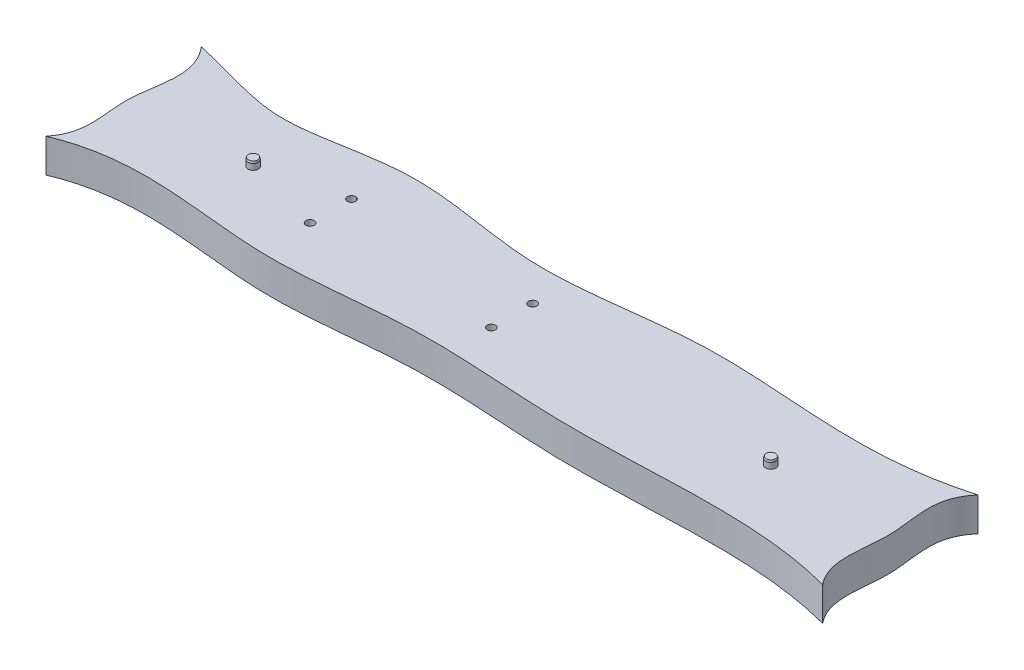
ISO-10303-21;
HEADER;
FILE_DESCRIPTION(('STEP AP214'),'2;1');
FILE_NAME('part.step','',(''),(''),'','','');
FILE_SCHEMA(('AUTOMOTIVE_DESIGN { 1 0 10303 214 1 1 1 1 }'));
ENDSEC;
DATA;
#1=APPLICATION_CONTEXT('core data for automotive mechanical design processes');
#2=APPLICATION_PROTOCOL_DEFINITION('international standard','automotive_design',2000,#1);
#3=PRODUCT_CONTEXT('',#1,'mechanical');
#4=PRODUCT('Part','Part','',(#3));
#5=PRODUCT_RELATED_PRODUCT_CATEGORY('part','',(#4));
#6=PRODUCT_DEFINITION_FORMATION('','',#4);
#7=PRODUCT_DEFINITION_CONTEXT('part definition',#1,'design');
#8=PRODUCT_DEFINITION('design','',#6,#7);
#9=PRODUCT_DEFINITION_SHAPE('','',#8);
#10=(LENGTH_UNIT() NAMED_UNIT(*) SI_UNIT(.MILLI.,.METRE.));
#11=(NAMED_UNIT(*) PLANE_ANGLE_UNIT() SI_UNIT($,.RADIAN.));
#12=(NAMED_UNIT(*) SI_UNIT($,.STERADIAN.) SOLID_ANGLE_UNIT());
#13=UNCERTAINTY_MEASURE_WITH_UNIT(LENGTH_MEASURE(1.E-05),#10,'distance_accuracy_value','');
#14=(GEOMETRIC_REPRESENTATION_CONTEXT(3) GLOBAL_UNCERTAINTY_ASSIGNED_CONTEXT((#13)) GLOBAL_UNIT_ASSIGNED_CONTEXT((#10,
#11,#12)) REPRESENTATION_CONTEXT('',''));
#15=CARTESIAN_POINT('',(0.,0.,0.));
#16=DIRECTION('',(0.,0.,1.));
#17=DIRECTION('',(1.,0.,0.));
#18=AXIS2_PLACEMENT_3D('',#15,#16,#17);
#19=CARTESIAN_POINT('',(-50.,0.35,0.));
#20=DIRECTION('',(0.,1.,0.));
#21=DIRECTION('',(1.,0.,0.));
#22=AXIS2_PLACEMENT_3D('',#19,#20,#21);
#23=CYLINDRICAL_SURFACE('',#22,1.);
#24=CARTESIAN_POINT('',(-50.,6.5,0.));
#25=DIRECTION('',(0.,1.,0.));
#26=DIRECTION('',(0.,0.,1.));
#27=AXIS2_PLACEMENT_3D('',#24,#25,#26);
#28=CIRCLE('',#27,1.);
#29=CARTESIAN_POINT('',(-49.,6.5,0.));
#30=VERTEX_POINT('',#29);
#31=EDGE_CURVE('E10',#30,#30,#28,.F.);
#32=CARTESIAN_POINT('',(-50.,7.65,0.));
#33=DIRECTION('',(0.,1.,0.));
#34=DIRECTION('',(1.,0.,0.));
#35=AXIS2_PLACEMENT_3D('',#32,#33,#34);
#36=CIRCLE('',#35,1.);
#37=CARTESIAN_POINT('',(-49.,7.65,0.));
#38=VERTEX_POINT('',#37);
#39=EDGE_CURVE('E24',#38,#38,#36,.T.);
#40=CARTESIAN_POINT('',(-49.,6.5,0.));
#41=CARTESIAN_POINT('',(-49.,6.51197916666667,0.));
#42=CARTESIAN_POINT('',(-49.,6.52395833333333,0.));
#43=CARTESIAN_POINT('',(-49.,6.54791666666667,0.));
#44=CARTESIAN_POINT('',(-49.,6.55989583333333,0.));
#45=CARTESIAN_POINT('',(-49.,6.58385416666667,0.));
#46=CARTESIAN_POINT('',(-49.,6.59583333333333,0.));
#47=CARTESIAN_POINT('',(-49.,6.61979166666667,0.));
#48=CARTESIAN_POINT('',(-49.,6.63177083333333,0.));
#49=CARTESIAN_POINT('',(-49.,6.65572916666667,0.));
#50=CARTESIAN_POINT('',(-49.,6.66770833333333,0.));
#51=CARTESIAN_POINT('',(-49.,6.69166666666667,0.));
#52=CARTESIAN_POINT('',(-49.,6.70364583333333,0.));
#53=CARTESIAN_POINT('',(-49.,6.72760416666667,0.));
#54=CARTESIAN_POINT('',(-49.,6.73958333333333,0.));
#55=CARTESIAN_POINT('',(-49.,6.76354166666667,0.));
#56=CARTESIAN_POINT('',(-49.,6.77552083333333,0.));
#57=CARTESIAN_POINT('',(-49.,6.79947916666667,0.));
#58=CARTESIAN_POINT('',(-49.,6.81145833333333,0.));
#59=CARTESIAN_POINT('',(-49.,6.83541666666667,0.));
#60=CARTESIAN_POINT('',(-49.,6.84739583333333,0.));
#61=CARTESIAN_POINT('',(-49.,6.87135416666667,0.));
#62=CARTESIAN_POINT('',(-49.,6.88333333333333,0.));
#63=CARTESIAN_POINT('',(-49.,6.90729166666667,0.));
#64=CARTESIAN_POINT('',(-49.,6.91927083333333,0.));
#65=CARTESIAN_POINT('',(-49.,6.94322916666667,0.));
#66=CARTESIAN_POINT('',(-49.,6.95520833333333,0.));
#67=CARTESIAN_POINT('',(-49.,6.97916666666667,0.));
#68=CARTESIAN_POINT('',(-49.,6.99114583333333,0.));
#69=CARTESIAN_POINT('',(-49.,7.01510416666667,0.));
#70=CARTESIAN_POINT('',(-49.,7.02708333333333,0.));
#71=CARTESIAN_POINT('',(-49.,7.05104166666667,0.));
#72=CARTESIAN_POINT('',(-49.,7.06302083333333,0.));
#73=CARTESIAN_POINT('',(-49.,7.08697916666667,0.));
#74=CARTESIAN_POINT('',(-49.,7.09895833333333,0.));
#75=CARTESIAN_POINT('',(-49.,7.12291666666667,0.));
#76=CARTESIAN_POINT('',(-49.,7.13489583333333,0.));
#77=CARTESIAN_POINT('',(-49.,7.15885416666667,0.));
#78=CARTESIAN_POINT('',(-49.,7.17083333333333,0.));
#79=CARTESIAN_POINT('',(-49.,7.19479166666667,0.));
#80=CARTESIAN_POINT('',(-49.,7.20677083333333,0.));
#81=CARTESIAN_POINT('',(-49.,7.23072916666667,0.));
#82=CARTESIAN_POINT('',(-49.,7.24270833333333,0.));
#83=CARTESIAN_POINT('',(-49.,7.26666666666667,0.));
#84=CARTESIAN_POINT('',(-49.,7.27864583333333,0.));
#85=CARTESIAN_POINT('',(-49.,7.30260416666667,0.));
#86=CARTESIAN_POINT('',(-49.,7.31458333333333,0.));
#87=CARTESIAN_POINT('',(-49.,7.33854166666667,0.));
#88=CARTESIAN_POINT('',(-49.,7.35052083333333,0.));
#89=CARTESIAN_POINT('',(-49.,7.37447916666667,0.));
#90=CARTESIAN_POINT('',(-49.,7.38645833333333,0.));
#91=CARTESIAN_POINT('',(-49.,7.41041666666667,0.));
#92=CARTESIAN_POINT('',(-49.,7.42239583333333,0.));
#93=CARTESIAN_POINT('',(-49.,7.44635416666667,0.));
#94=CARTESIAN_POINT('',(-49.,7.45833333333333,0.));
#95=CARTESIAN_POINT('',(-49.,7.48229166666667,0.));
#96=CARTESIAN_POINT('',(-49.,7.49427083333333,0.));
#97=CARTESIAN_POINT('',(-49.,7.51822916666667,0.));
#98=CARTESIAN_POINT('',(-49.,7.53020833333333,0.));
#99=CARTESIAN_POINT('',(-49.,7.55416666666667,0.));
#100=CARTESIAN_POINT('',(-49.,7.56614583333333,0.));
#101=CARTESIAN_POINT('',(-49.,7.59010416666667,0.));
#102=CARTESIAN_POINT('',(-49.,7.60208333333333,0.));
#103=CARTESIAN_POINT('',(-49.,7.62604166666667,0.));
#104=CARTESIAN_POINT('',(-49.,7.63802083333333,0.));
#105=CARTESIAN_POINT('',(-49.,7.65,0.));
#106=B_SPLINE_CURVE_WITH_KNOTS('',3,(#40,#41,#42,#43,#44,#45,#46,#47,#48,#49,#50,#51,#52,#53,
#54,#55,#56,#57,#58,#59,#60,#61,#62,#63,#64,#65,#66,#67,#68,#69,#70,#71,#72,#73,#74,#75,#76,#77,
#78,#79,#80,#81,#82,#83,#84,#85,#86,#87,#88,#89,#90,#91,#92,#93,#94,#95,#96,#97,#98,#99,#100,
#101,#102,#103,#104,#105),.UNSPECIFIED.,.F.,.F.,(4,2,2,2,2,2,2,2,2,2,2,2,2,2,2,2,2,2,2,2,2,2,2,
2,2,2,2,2,2,2,2,2,4),(0.,0.0359375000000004,0.0718749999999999,0.1078125,0.14375,0.1796875,
0.215625,0.2515625,0.2875,0.3234375,0.359375,0.3953125,0.43125,0.4671875,0.503125,0.5390625,
0.575,0.6109375,0.646875,0.6828125,0.71875,0.7546875,0.790625,0.8265625,0.8625,0.8984375,
0.934375,0.9703125,1.00625,1.0421875,1.078125,1.1140625,1.15),.UNSPECIFIED.);
#107=EDGE_CURVE('BSEAM16',#30,#38,#106,.T.);
#108=ORIENTED_EDGE('',*,*,#31,.F.);
#109=ORIENTED_EDGE('',*,*,#39,.F.);
#110=ORIENTED_EDGE('',*,*,#107,.T.);
#111=ORIENTED_EDGE('',*,*,#107,.F.);
#112=EDGE_LOOP('',(#108,#110,#109,#111));
#113=FACE_BOUND('',#112,.T.);
#114=ADVANCED_FACE('F16',(#113),#23,.T.);
#115=CARTESIAN_POINT('',(-50.,7.65,0.));
#116=DIRECTION('',(0.,-1.,0.));
#117=DIRECTION('',(1.,0.,0.));
#118=AXIS2_PLACEMENT_3D('',#115,#116,#117);
#119=CONICAL_SURFACE('',#118,1.,0.26179938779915);
#120=CARTESIAN_POINT('',(-50.,8.,0.));
#121=DIRECTION('',(0.,1.,0.));
#122=DIRECTION('',(1.,0.,0.));
#123=AXIS2_PLACEMENT_3D('',#120,#121,#122);
#124=CIRCLE('',#123,0.906217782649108);
#125=CARTESIAN_POINT('',(-49.0937822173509,8.,0.));
#126=VERTEX_POINT('',#125);
#127=EDGE_CURVE('E150',#126,#126,#124,.T.);
#128=ORIENTED_EDGE('',*,*,#127,.F.);
#129=EDGE_LOOP('',(#128));
#130=FACE_BOUND('',#129,.T.);
#131=ORIENTED_EDGE('',*,*,#39,.T.);
#132=EDGE_LOOP('',(#131));
#133=FACE_BOUND('',#132,.T.);
#134=ADVANCED_FACE('F158',(#130,#133),#119,.T.);
#135=CARTESIAN_POINT('',(-50.,8.,0.));
#136=DIRECTION('',(0.,1.,0.));
#137=DIRECTION('',(1.,0.,0.));
#138=AXIS2_PLACEMENT_3D('',#135,#136,#137);
#139=PLANE('',#138);
#140=ORIENTED_EDGE('',*,*,#127,.T.);
#141=EDGE_LOOP('',(#140));
#142=FACE_BOUND('',#141,.T.);
#143=ADVANCED_FACE('F166',(#142),#139,.T.);
#144=CARTESIAN_POINT('',(0.,6.5,0.));
#145=DIRECTION('',(0.,1.,0.));
#146=DIRECTION('',(0.,0.,1.));
#147=AXIS2_PLACEMENT_3D('',#144,#145,#146);
#148=PLANE('',#147);
#149=CARTESIAN_POINT('',(0.,6.5,-4.));
#150=DIRECTION('',(0.,1.,0.));
#151=DIRECTION('',(0.,0.,1.));
#152=AXIS2_PLACEMENT_3D('',#149,#150,#151);
#153=CIRCLE('',#152,0.799999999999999);
#154=CARTESIAN_POINT('',(0.,6.5,-3.2));
#155=VERTEX_POINT('',#154);
#156=EDGE_CURVE('E284',#155,#155,#153,.T.);
#157=ORIENTED_EDGE('',*,*,#156,.F.);
#158=EDGE_LOOP('',(#157));
#159=FACE_BOUND('',#158,.T.);
#160=CARTESIAN_POINT('',(-35.,6.5,4.));
#161=DIRECTION('',(0.,1.,0.));
#162=DIRECTION('',(0.,0.,1.));
#163=AXIS2_PLACEMENT_3D('',#160,#161,#162);
#164=CIRCLE('',#163,0.800000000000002);
#165=CARTESIAN_POINT('',(-35.,6.5,4.8));
#166=VERTEX_POINT('',#165);
#167=EDGE_CURVE('E309',#166,#166,#164,.T.);
#168=ORIENTED_EDGE('',*,*,#167,.F.);
#169=EDGE_LOOP('',(#168));
#170=FACE_BOUND('',#169,.T.);
#171=CARTESIAN_POINT('',(-35.,6.5,-4.));
#172=DIRECTION('',(0.,1.,0.));
#173=DIRECTION('',(0.,0.,1.));
#174=AXIS2_PLACEMENT_3D('',#171,#172,#173);
#175=CIRCLE('',#174,0.800000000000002);
#176=CARTESIAN_POINT('',(-35.,6.5,-3.19999999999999));
#177=VERTEX_POINT('',#176);
#178=EDGE_CURVE('E293',#177,#177,#175,.T.);
#179=ORIENTED_EDGE('',*,*,#178,.F.);
#180=EDGE_LOOP('',(#179));
#181=FACE_BOUND('',#180,.T.);
#182=CARTESIAN_POINT('',(0.,6.5,4.));
#183=DIRECTION('',(0.,1.,0.));
#184=DIRECTION('',(0.,0.,1.));
#185=AXIS2_PLACEMENT_3D('',#182,#183,#184);
#186=CIRCLE('',#185,0.799999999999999);
#187=CARTESIAN_POINT('',(0.,6.5,4.8));
#188=VERTEX_POINT('',#187);
#189=EDGE_CURVE('E294',#188,#188,#186,.T.);
#190=ORIENTED_EDGE('',*,*,#189,.F.);
#191=EDGE_LOOP('',(#190));
#192=FACE_BOUND('',#191,.T.);
#193=ORIENTED_EDGE('',*,*,#31,.T.);
#194=EDGE_LOOP('',(#193));
#195=FACE_BOUND('',#194,.T.);
#196=CARTESIAN_POINT('',(50.,6.5,0.));
#197=DIRECTION('',(0.,1.,0.));
#198=DIRECTION('',(0.,0.,1.));
#199=AXIS2_PLACEMENT_3D('',#196,#197,#198);
#200=CIRCLE('',#199,1.);
#201=CARTESIAN_POINT('',(51.,6.5,0.));
#202=VERTEX_POINT('',#201);
#203=EDGE_CURVE('E146',#202,#202,#200,.T.);
#204=ORIENTED_EDGE('',*,*,#203,.F.);
#205=EDGE_LOOP('',(#204));
#206=FACE_BOUND('',#205,.T.);
#207=CARTESIAN_POINT('',(-75.,6.5,15.));
#208=CARTESIAN_POINT('',(-71.4148410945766,6.5,10.6736901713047));
#209=CARTESIAN_POINT('',(-75.472012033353,6.5,0.285714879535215));
#210=CARTESIAN_POINT('',(-70.4192760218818,6.5,-9.70464301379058));
#211=CARTESIAN_POINT('',(-75.,6.5,-15.));
#212=B_SPLINE_CURVE_WITH_KNOTS('',3,(#207,#208,#209,#210,#211),.UNSPECIFIED.,.F.,.F.,(4,1,4),
(0.,0.467365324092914,1.),.UNSPECIFIED.);
#213=CARTESIAN_POINT('',(-75.,6.5,15.));
#214=VERTEX_POINT('',#213);
#215=CARTESIAN_POINT('',(-75.,6.5,-15.));
#216=VERTEX_POINT('',#215);
#217=EDGE_CURVE('E47',#214,#216,#212,.T.);
#218=ORIENTED_EDGE('',*,*,#217,.F.);
#219=CARTESIAN_POINT('',(75.,6.5,15.));
#220=CARTESIAN_POINT('',(57.5503119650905,6.5,10.3128320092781));
#221=CARTESIAN_POINT('',(30.0449047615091,6.5,14.8848879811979));
#222=CARTESIAN_POINT('',(-6.28020412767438,6.5,10.5430593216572));
#223=CARTESIAN_POINT('',(-38.7567005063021,6.5,16.1653498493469));
#224=CARTESIAN_POINT('',(-61.4168501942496,6.5,9.28593484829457));
#225=CARTESIAN_POINT('',(-75.,6.5,15.));
#226=B_SPLINE_CURVE_WITH_KNOTS('',3,(#219,#220,#221,#222,#223,#224,#225),.UNSPECIFIED.,.F.,.F.,
(4,1,1,1,4),(0.,0.350642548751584,0.548079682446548,0.724378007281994,1.),.UNSPECIFIED.);
#227=CARTESIAN_POINT('',(75.,6.5,15.));
#228=VERTEX_POINT('',#227);
#229=EDGE_CURVE('E87',#228,#214,#226,.T.);
#230=ORIENTED_EDGE('',*,*,#229,.F.);
#231=CARTESIAN_POINT('',(75.,6.5,-15.));
#232=CARTESIAN_POINT('',(70.8118051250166,6.5,-10.1914686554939));
#233=CARTESIAN_POINT('',(75.2042977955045,6.5,-0.0639921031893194));
#234=CARTESIAN_POINT('',(71.2219836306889,6.5,10.3684710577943));
#235=CARTESIAN_POINT('',(75.,6.5,15.));
#236=B_SPLINE_CURVE_WITH_KNOTS('',3,(#231,#232,#233,#234,#235),.UNSPECIFIED.,.F.,.F.,(4,1,4),
(0.,0.499403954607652,1.),.UNSPECIFIED.);
#237=CARTESIAN_POINT('',(75.,6.5,-15.));
#238=VERTEX_POINT('',#237);
#239=EDGE_CURVE('E104',#238,#228,#236,.T.);
#240=ORIENTED_EDGE('',*,*,#239,.F.);
#241=CARTESIAN_POINT('',(-75.,6.5,-15.));
#242=CARTESIAN_POINT('',(-65.799010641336,6.5,-12.756205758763));
#243=CARTESIAN_POINT('',(-55.441355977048,6.5,-8.71622552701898));
#244=CARTESIAN_POINT('',(-32.3300705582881,6.5,-15.9143391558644));
#245=CARTESIAN_POINT('',(-6.39686660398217,6.5,-8.52145611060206));
#246=CARTESIAN_POINT('',(30.8334938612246,6.5,-16.7981873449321));
#247=CARTESIAN_POINT('',(55.5768603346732,6.5,-9.43802997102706));
#248=CARTESIAN_POINT('',(75.,6.5,-15.));
#249=B_SPLINE_CURVE_WITH_KNOTS('',3,(#241,#242,#243,#244,#245,#246,#247,#248),.UNSPECIFIED.,.F.,
.F.,(4,1,1,1,1,4),(0.,0.131517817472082,0.278546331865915,0.453220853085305,0.648866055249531,
1.),.UNSPECIFIED.);
#250=EDGE_CURVE('E92',#216,#238,#249,.T.);
#251=ORIENTED_EDGE('',*,*,#250,.F.);
#252=EDGE_LOOP('',(#218,#230,#240,#251));
#253=FACE_BOUND('',#252,.T.);
#254=ADVANCED_FACE('F124',(#159,#170,#181,#192,#195,#206,#253),#148,.T.);
#255=CARTESIAN_POINT('',(0.,0.,0.));
#256=DIRECTION('',(0.,1.,0.));
#257=DIRECTION('',(0.,0.,1.));
#258=AXIS2_PLACEMENT_3D('',#255,#256,#257);
#259=PLANE('',#258);
#260=CARTESIAN_POINT('',(50.,0.,0.));
#261=DIRECTION('',(0.,1.,0.));
#262=DIRECTION('',(0.,0.,1.));
#263=AXIS2_PLACEMENT_3D('',#260,#261,#262);
#264=CIRCLE('',#263,1.);
#265=CARTESIAN_POINT('',(50.,0.,1.));
#266=VERTEX_POINT('',#265);
#267=EDGE_CURVE('E270',#266,#266,#264,.T.);
#268=ORIENTED_EDGE('',*,*,#267,.T.);
#269=EDGE_LOOP('',(#268));
#270=FACE_BOUND('',#269,.T.);
#271=CARTESIAN_POINT('',(0.,0.,-4.));
#272=DIRECTION('',(0.,1.,0.));
#273=DIRECTION('',(0.,0.,1.));
#274=AXIS2_PLACEMENT_3D('',#271,#272,#273);
#275=CIRCLE('',#274,0.799999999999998);
#276=CARTESIAN_POINT('',(0.,0.,-3.2));
#277=VERTEX_POINT('',#276);
#278=EDGE_CURVE('E280',#277,#277,#275,.T.);
#279=ORIENTED_EDGE('',*,*,#278,.T.);
#280=EDGE_LOOP('',(#279));
#281=FACE_BOUND('',#280,.T.);
#282=CARTESIAN_POINT('',(-50.,0.,0.));
#283=DIRECTION('',(0.,1.,0.));
#284=DIRECTION('',(0.,0.,1.));
#285=AXIS2_PLACEMENT_3D('',#282,#283,#284);
#286=CIRCLE('',#285,1.);
#287=CARTESIAN_POINT('',(-50.,0.,1.));
#288=VERTEX_POINT('',#287);
#289=EDGE_CURVE('E264',#288,#288,#286,.T.);
#290=ORIENTED_EDGE('',*,*,#289,.T.);
#291=EDGE_LOOP('',(#290));
#292=FACE_BOUND('',#291,.T.);
#293=CARTESIAN_POINT('',(-35.,0.,4.));
#294=DIRECTION('',(0.,1.,0.));
#295=DIRECTION('',(0.,0.,1.));
#296=AXIS2_PLACEMENT_3D('',#293,#294,#295);
#297=CIRCLE('',#296,0.799999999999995);
#298=CARTESIAN_POINT('',(-35.,0.,4.8));
#299=VERTEX_POINT('',#298);
#300=EDGE_CURVE('E298',#299,#299,#297,.T.);
#301=ORIENTED_EDGE('',*,*,#300,.T.);
#302=EDGE_LOOP('',(#301));
#303=FACE_BOUND('',#302,.T.);
#304=CARTESIAN_POINT('',(-35.,0.,-4.));
#305=DIRECTION('',(0.,1.,0.));
#306=DIRECTION('',(0.,0.,1.));
#307=AXIS2_PLACEMENT_3D('',#304,#305,#306);
#308=CIRCLE('',#307,0.799999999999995);
#309=CARTESIAN_POINT('',(-35.,0.,-3.2));
#310=VERTEX_POINT('',#309);
#311=EDGE_CURVE('E289',#310,#310,#308,.T.);
#312=ORIENTED_EDGE('',*,*,#311,.T.);
#313=EDGE_LOOP('',(#312));
#314=FACE_BOUND('',#313,.T.);
#315=CARTESIAN_POINT('',(0.,0.,4.));
#316=DIRECTION('',(0.,1.,0.));
#317=DIRECTION('',(0.,0.,1.));
#318=AXIS2_PLACEMENT_3D('',#315,#316,#317);
#319=CIRCLE('',#318,0.799999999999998);
#320=CARTESIAN_POINT('',(0.,0.,4.8));
#321=VERTEX_POINT('',#320);
#322=EDGE_CURVE('E288',#321,#321,#319,.T.);
#323=ORIENTED_EDGE('',*,*,#322,.T.);
#324=EDGE_LOOP('',(#323));
#325=FACE_BOUND('',#324,.T.);
#326=CARTESIAN_POINT('',(75.,0.,15.));
#327=CARTESIAN_POINT('',(57.5503119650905,0.,10.3128320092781));
#328=CARTESIAN_POINT('',(30.0449047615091,0.,14.8848879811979));
#329=CARTESIAN_POINT('',(-6.28020412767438,0.,10.5430593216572));
#330=CARTESIAN_POINT('',(-38.7567005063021,0.,16.1653498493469));
#331=CARTESIAN_POINT('',(-61.4168501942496,0.,9.28593484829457));
#332=CARTESIAN_POINT('',(-75.,0.,15.));
#333=B_SPLINE_CURVE_WITH_KNOTS('',3,(#326,#327,#328,#329,#330,#331,#332),.UNSPECIFIED.,.F.,.F.,
(4,1,1,1,4),(0.,0.350642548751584,0.548079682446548,0.724378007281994,1.),.UNSPECIFIED.);
#334=CARTESIAN_POINT('',(75.,0.,15.));
#335=VERTEX_POINT('',#334);
#336=CARTESIAN_POINT('',(-75.,0.,15.));
#337=VERTEX_POINT('',#336);
#338=EDGE_CURVE('E85',#335,#337,#333,.T.);
#339=ORIENTED_EDGE('',*,*,#338,.T.);
#340=CARTESIAN_POINT('',(-75.,0.,15.));
#341=CARTESIAN_POINT('',(-71.4148410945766,0.,10.6736901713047));
#342=CARTESIAN_POINT('',(-75.472012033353,0.,0.285714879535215));
#343=CARTESIAN_POINT('',(-70.4192760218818,0.,-9.70464301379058));
#344=CARTESIAN_POINT('',(-75.,0.,-15.));
#345=B_SPLINE_CURVE_WITH_KNOTS('',3,(#340,#341,#342,#343,#344),.UNSPECIFIED.,.F.,.F.,(4,1,4),
(0.,0.467365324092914,1.),.UNSPECIFIED.);
#346=CARTESIAN_POINT('',(-75.,0.,-15.));
#347=VERTEX_POINT('',#346);
#348=EDGE_CURVE('E69',#337,#347,#345,.T.);
#349=ORIENTED_EDGE('',*,*,#348,.T.);
#350=CARTESIAN_POINT('',(-75.,0.,-15.));
#351=CARTESIAN_POINT('',(-65.799010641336,0.,-12.756205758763));
#352=CARTESIAN_POINT('',(-55.441355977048,0.,-8.71622552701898));
#353=CARTESIAN_POINT('',(-32.3300705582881,0.,-15.9143391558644));
#354=CARTESIAN_POINT('',(-6.39686660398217,0.,-8.52145611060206));
#355=CARTESIAN_POINT('',(30.8334938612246,0.,-16.7981873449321));
#356=CARTESIAN_POINT('',(55.5768603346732,0.,-9.43802997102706));
#357=CARTESIAN_POINT('',(75.,0.,-15.));
#358=B_SPLINE_CURVE_WITH_KNOTS('',3,(#350,#351,#352,#353,#354,#355,#356,#357),.UNSPECIFIED.,.F.,
.F.,(4,1,1,1,1,4),(0.,0.131517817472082,0.278546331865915,0.453220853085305,0.648866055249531,
1.),.UNSPECIFIED.);
#359=CARTESIAN_POINT('',(75.,0.,-15.));
#360=VERTEX_POINT('',#359);
#361=EDGE_CURVE('E83',#347,#360,#358,.T.);
#362=ORIENTED_EDGE('',*,*,#361,.T.);
#363=CARTESIAN_POINT('',(75.,0.,-15.));
#364=CARTESIAN_POINT('',(70.8118051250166,0.,-10.1914686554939));
#365=CARTESIAN_POINT('',(75.2042977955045,0.,-0.0639921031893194));
#366=CARTESIAN_POINT('',(71.2219836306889,0.,10.3684710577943));
#367=CARTESIAN_POINT('',(75.,0.,15.));
#368=B_SPLINE_CURVE_WITH_KNOTS('',3,(#363,#364,#365,#366,#367),.UNSPECIFIED.,.F.,.F.,(4,1,4),
(0.,0.499403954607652,1.),.UNSPECIFIED.);
#369=EDGE_CURVE('E36',#360,#335,#368,.T.);
#370=ORIENTED_EDGE('',*,*,#369,.T.);
#371=EDGE_LOOP('',(#339,#349,#362,#370));
#372=FACE_BOUND('',#371,.T.);
#373=ADVANCED_FACE('F82',(#270,#281,#292,#303,#314,#325,#372),#259,.F.);
#374=DIRECTION('',(0.,1.,0.));
#375=VECTOR('',#374,1.);
#376=SURFACE_OF_LINEAR_EXTRUSION('',#333,#375);
#377=ORIENTED_EDGE('',*,*,#229,.T.);
#378=DIRECTION('',(0.,-1.,0.));
#379=VECTOR('',#378,1.);
#380=CARTESIAN_POINT('',(-75.,6.5,15.));
#381=LINE('',#380,#379);
#382=EDGE_CURVE('E77',#214,#337,#381,.T.);
#383=ORIENTED_EDGE('',*,*,#382,.T.);
#384=ORIENTED_EDGE('',*,*,#338,.F.);
#385=DIRECTION('',(0.,-1.,0.));
#386=VECTOR('',#385,1.);
#387=CARTESIAN_POINT('',(75.,6.5,15.));
#388=LINE('',#387,#386);
#389=EDGE_CURVE('E91',#228,#335,#388,.T.);
#390=ORIENTED_EDGE('',*,*,#389,.F.);
#391=EDGE_LOOP('',(#377,#383,#384,#390));
#392=FACE_BOUND('',#391,.T.);
#393=ADVANCED_FACE('F119',(#392),#376,.F.);
#394=DIRECTION('',(0.,1.,0.));
#395=VECTOR('',#394,1.);
#396=SURFACE_OF_LINEAR_EXTRUSION('',#358,#395);
#397=ORIENTED_EDGE('',*,*,#250,.T.);
#398=DIRECTION('',(0.,-1.,0.));
#399=VECTOR('',#398,1.);
#400=CARTESIAN_POINT('',(75.,6.5,-15.));
#401=LINE('',#400,#399);
#402=EDGE_CURVE('E76',#238,#360,#401,.T.);
#403=ORIENTED_EDGE('',*,*,#402,.T.);
#404=ORIENTED_EDGE('',*,*,#361,.F.);
#405=DIRECTION('',(0.,-1.,0.));
#406=VECTOR('',#405,1.);
#407=CARTESIAN_POINT('',(-75.,6.5,-15.));
#408=LINE('',#407,#406);
#409=EDGE_CURVE('E66',#216,#347,#408,.T.);
#410=ORIENTED_EDGE('',*,*,#409,.F.);
#411=EDGE_LOOP('',(#397,#403,#404,#410));
#412=FACE_BOUND('',#411,.T.);
#413=ADVANCED_FACE('F89',(#412),#396,.F.);
#414=DIRECTION('',(0.,1.,0.));
#415=VECTOR('',#414,1.);
#416=SURFACE_OF_LINEAR_EXTRUSION('',#368,#415);
#417=ORIENTED_EDGE('',*,*,#239,.T.);
#418=ORIENTED_EDGE('',*,*,#389,.T.);
#419=ORIENTED_EDGE('',*,*,#369,.F.);
#420=ORIENTED_EDGE('',*,*,#402,.F.);
#421=EDGE_LOOP('',(#417,#418,#419,#420));
#422=FACE_BOUND('',#421,.T.);
#423=ADVANCED_FACE('F118',(#422),#416,.F.);
#424=DIRECTION('',(0.,1.,0.));
#425=VECTOR('',#424,1.);
#426=SURFACE_OF_LINEAR_EXTRUSION('',#345,#425);
#427=ORIENTED_EDGE('',*,*,#217,.T.);
#428=ORIENTED_EDGE('',*,*,#409,.T.);
#429=ORIENTED_EDGE('',*,*,#348,.F.);
#430=ORIENTED_EDGE('',*,*,#382,.F.);
#431=EDGE_LOOP('',(#427,#428,#429,#430));
#432=FACE_BOUND('',#431,.T.);
#433=ADVANCED_FACE('F68',(#432),#426,.F.);
#434=CARTESIAN_POINT('',(50.,0.35,0.));
#435=DIRECTION('',(0.,1.,0.));
#436=DIRECTION('',(1.,0.,0.));
#437=AXIS2_PLACEMENT_3D('',#434,#435,#436);
#438=CYLINDRICAL_SURFACE('',#437,1.);
#439=CARTESIAN_POINT('',(50.,7.65,0.));
#440=DIRECTION('',(0.,1.,0.));
#441=DIRECTION('',(1.,0.,0.));
#442=AXIS2_PLACEMENT_3D('',#439,#440,#441);
#443=CIRCLE('',#442,1.);
#444=CARTESIAN_POINT('',(51.,7.65,0.));
#445=VERTEX_POINT('',#444);
#446=EDGE_CURVE('E183',#445,#445,#443,.T.);
#447=CARTESIAN_POINT('',(51.,6.5,0.));
#448=CARTESIAN_POINT('',(51.,6.51197916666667,0.));
#449=CARTESIAN_POINT('',(51.,6.52395833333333,0.));
#450=CARTESIAN_POINT('',(51.,6.54791666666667,0.));
#451=CARTESIAN_POINT('',(51.,6.55989583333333,0.));
#452=CARTESIAN_POINT('',(51.,6.58385416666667,0.));
#453=CARTESIAN_POINT('',(51.,6.59583333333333,0.));
#454=CARTESIAN_POINT('',(51.,6.61979166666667,0.));
#455=CARTESIAN_POINT('',(51.,6.63177083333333,0.));
#456=CARTESIAN_POINT('',(51.,6.65572916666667,0.));
#457=CARTESIAN_POINT('',(51.,6.66770833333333,0.));
#458=CARTESIAN_POINT('',(51.,6.69166666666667,0.));
#459=CARTESIAN_POINT('',(51.,6.70364583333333,0.));
#460=CARTESIAN_POINT('',(51.,6.72760416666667,0.));
#461=CARTESIAN_POINT('',(51.,6.73958333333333,0.));
#462=CARTESIAN_POINT('',(51.,6.76354166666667,0.));
#463=CARTESIAN_POINT('',(51.,6.77552083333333,0.));
#464=CARTESIAN_POINT('',(51.,6.79947916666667,0.));
#465=CARTESIAN_POINT('',(51.,6.81145833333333,0.));
#466=CARTESIAN_POINT('',(51.,6.83541666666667,0.));
#467=CARTESIAN_POINT('',(51.,6.84739583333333,0.));
#468=CARTESIAN_POINT('',(51.,6.87135416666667,0.));
#469=CARTESIAN_POINT('',(51.,6.88333333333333,0.));
#470=CARTESIAN_POINT('',(51.,6.90729166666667,0.));
#471=CARTESIAN_POINT('',(51.,6.91927083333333,0.));
#472=CARTESIAN_POINT('',(51.,6.94322916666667,0.));
#473=CARTESIAN_POINT('',(51.,6.95520833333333,0.));
#474=CARTESIAN_POINT('',(51.,6.97916666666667,0.));
#475=CARTESIAN_POINT('',(51.,6.99114583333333,0.));
#476=CARTESIAN_POINT('',(51.,7.01510416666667,0.));
#477=CARTESIAN_POINT('',(51.,7.02708333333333,0.));
#478=CARTESIAN_POINT('',(51.,7.05104166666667,0.));
#479=CARTESIAN_POINT('',(51.,7.06302083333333,0.));
#480=CARTESIAN_POINT('',(51.,7.08697916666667,0.));
#481=CARTESIAN_POINT('',(51.,7.09895833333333,0.));
#482=CARTESIAN_POINT('',(51.,7.12291666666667,0.));
#483=CARTESIAN_POINT('',(51.,7.13489583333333,0.));
#484=CARTESIAN_POINT('',(51.,7.15885416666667,0.));
#485=CARTESIAN_POINT('',(51.,7.17083333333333,0.));
#486=CARTESIAN_POINT('',(51.,7.19479166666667,0.));
#487=CARTESIAN_POINT('',(51.,7.20677083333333,0.));
#488=CARTESIAN_POINT('',(51.,7.23072916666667,0.));
#489=CARTESIAN_POINT('',(51.,7.24270833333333,0.));
#490=CARTESIAN_POINT('',(51.,7.26666666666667,0.));
#491=CARTESIAN_POINT('',(51.,7.27864583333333,0.));
#492=CARTESIAN_POINT('',(51.,7.30260416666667,0.));
#493=CARTESIAN_POINT('',(51.,7.31458333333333,0.));
#494=CARTESIAN_POINT('',(51.,7.33854166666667,0.));
#495=CARTESIAN_POINT('',(51.,7.35052083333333,0.));
#496=CARTESIAN_POINT('',(51.,7.37447916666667,0.));
#497=CARTESIAN_POINT('',(51.,7.38645833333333,0.));
#498=CARTESIAN_POINT('',(51.,7.41041666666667,0.));
#499=CARTESIAN_POINT('',(51.,7.42239583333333,0.));
#500=CARTESIAN_POINT('',(51.,7.44635416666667,0.));
#501=CARTESIAN_POINT('',(51.,7.45833333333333,0.));
#502=CARTESIAN_POINT('',(51.,7.48229166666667,0.));
#503=CARTESIAN_POINT('',(51.,7.49427083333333,0.));
#504=CARTESIAN_POINT('',(51.,7.51822916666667,0.));
#505=CARTESIAN_POINT('',(51.,7.53020833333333,0.));
#506=CARTESIAN_POINT('',(51.,7.55416666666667,0.));
#507=CARTESIAN_POINT('',(51.,7.56614583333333,0.));
#508=CARTESIAN_POINT('',(51.,7.59010416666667,0.));
#509=CARTESIAN_POINT('',(51.,7.60208333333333,0.));
#510=CARTESIAN_POINT('',(51.,7.62604166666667,0.));
#511=CARTESIAN_POINT('',(51.,7.63802083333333,0.));
#512=CARTESIAN_POINT('',(51.,7.65,0.));
#513=B_SPLINE_CURVE_WITH_KNOTS('',3,(#447,#448,#449,#450,#451,#452,#453,#454,#455,#456,#457,
#458,#459,#460,#461,#462,#463,#464,#465,#466,#467,#468,#469,#470,#471,#472,#473,#474,#475,#476,
#477,#478,#479,#480,#481,#482,#483,#484,#485,#486,#487,#488,#489,#490,#491,#492,#493,#494,#495,
#496,#497,#498,#499,#500,#501,#502,#503,#504,#505,#506,#507,#508,#509,#510,#511,#512),
.UNSPECIFIED.,.F.,.F.,(4,2,2,2,2,2,2,2,2,2,2,2,2,2,2,2,2,2,2,2,2,2,2,2,2,2,2,2,2,2,2,2,4),(0.,
0.0359375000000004,0.0718749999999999,0.1078125,0.14375,0.1796875,0.215625,0.2515625,0.2875,
0.3234375,0.359375,0.3953125,0.43125,0.4671875,0.503125,0.5390625,0.575,0.6109375,0.646875,
0.6828125,0.71875,0.7546875,0.790625,0.8265625,0.8625,0.8984375,0.934375,0.9703125,1.00625,
1.0421875,1.078125,1.1140625,1.15),.UNSPECIFIED.);
#514=EDGE_CURVE('BSEAM205',#202,#445,#513,.T.);
#515=ORIENTED_EDGE('',*,*,#203,.T.);
#516=ORIENTED_EDGE('',*,*,#446,.F.);
#517=ORIENTED_EDGE('',*,*,#514,.T.);
#518=ORIENTED_EDGE('',*,*,#514,.F.);
#519=EDGE_LOOP('',(#515,#517,#516,#518));
#520=FACE_BOUND('',#519,.T.);
#521=ADVANCED_FACE('F205',(#520),#438,.T.);
#522=CARTESIAN_POINT('',(50.,7.65,0.));
#523=DIRECTION('',(0.,-1.,0.));
#524=DIRECTION('',(1.,0.,0.));
#525=AXIS2_PLACEMENT_3D('',#522,#523,#524);
#526=CONICAL_SURFACE('',#525,1.,0.26179938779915);
#527=CARTESIAN_POINT('',(50.,8.,0.));
#528=DIRECTION('',(0.,1.,0.));
#529=DIRECTION('',(1.,0.,0.));
#530=AXIS2_PLACEMENT_3D('',#527,#528,#529);
#531=CIRCLE('',#530,0.906217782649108);
#532=CARTESIAN_POINT('',(50.9062177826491,8.,0.));
#533=VERTEX_POINT('',#532);
#534=EDGE_CURVE('E279',#533,#533,#531,.T.);
#535=ORIENTED_EDGE('',*,*,#534,.F.);
#536=EDGE_LOOP('',(#535));
#537=FACE_BOUND('',#536,.T.);
#538=ORIENTED_EDGE('',*,*,#446,.T.);
#539=EDGE_LOOP('',(#538));
#540=FACE_BOUND('',#539,.T.);
#541=ADVANCED_FACE('F208',(#537,#540),#526,.T.);
#542=CARTESIAN_POINT('',(50.,8.,0.));
#543=DIRECTION('',(0.,1.,0.));
#544=DIRECTION('',(1.,0.,0.));
#545=AXIS2_PLACEMENT_3D('',#542,#543,#544);
#546=PLANE('',#545);
#547=ORIENTED_EDGE('',*,*,#534,.T.);
#548=EDGE_LOOP('',(#547));
#549=FACE_BOUND('',#548,.T.);
#550=ADVANCED_FACE('F212',(#549),#546,.T.);
#551=CARTESIAN_POINT('',(-50.,6.5,0.));
#552=DIRECTION('',(0.,1.,0.));
#553=DIRECTION('',(0.,0.,1.));
#554=AXIS2_PLACEMENT_3D('',#551,#552,#553);
#555=CYLINDRICAL_SURFACE('',#554,1.);
#556=ORIENTED_EDGE('',*,*,#289,.F.);
#557=EDGE_LOOP('',(#556));
#558=FACE_BOUND('',#557,.T.);
#559=CARTESIAN_POINT('',(-50.,0.35,0.));
#560=DIRECTION('',(0.,-1.,0.));
#561=DIRECTION('',(-1.,0.,0.));
#562=AXIS2_PLACEMENT_3D('',#559,#560,#561);
#563=CIRCLE('',#562,1.);
#564=CARTESIAN_POINT('',(-51.,0.35,0.));
#565=VERTEX_POINT('',#564);
#566=EDGE_CURVE('E305',#565,#565,#563,.T.);
#567=ORIENTED_EDGE('',*,*,#566,.F.);
#568=EDGE_LOOP('',(#567));
#569=FACE_BOUND('',#568,.T.);
#570=ADVANCED_FACE('F216',(#558,#569),#555,.F.);
#571=CARTESIAN_POINT('',(-50.,0.35,0.));
#572=DIRECTION('',(0.,1.,0.));
#573=DIRECTION('',(-1.,0.,0.));
#574=AXIS2_PLACEMENT_3D('',#571,#572,#573);
#575=CONICAL_SURFACE('',#574,1.,0.26179938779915);
#576=CARTESIAN_POINT('',(-50.,0.,0.));
#577=DIRECTION('',(0.,-1.,0.));
#578=DIRECTION('',(-1.,0.,0.));
#579=AXIS2_PLACEMENT_3D('',#576,#577,#578);
#580=CIRCLE('',#579,0.906217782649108);
#581=CARTESIAN_POINT('',(-50.9062177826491,0.,0.));
#582=VERTEX_POINT('',#581);
#583=EDGE_CURVE('E274',#582,#582,#580,.T.);
#584=ORIENTED_EDGE('',*,*,#583,.F.);
#585=EDGE_LOOP('',(#584));
#586=FACE_BOUND('',#585,.T.);
#587=ORIENTED_EDGE('',*,*,#566,.T.);
#588=EDGE_LOOP('',(#587));
#589=FACE_BOUND('',#588,.T.);
#590=ADVANCED_FACE('F226',(#586,#589),#575,.T.);
#591=CARTESIAN_POINT('',(0.,6.5,4.));
#592=DIRECTION('',(0.,1.,0.));
#593=DIRECTION('',(0.,0.,1.));
#594=AXIS2_PLACEMENT_3D('',#591,#592,#593);
#595=CYLINDRICAL_SURFACE('',#594,0.799999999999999);
#596=ORIENTED_EDGE('',*,*,#322,.F.);
#597=EDGE_LOOP('',(#596));
#598=FACE_BOUND('',#597,.T.);
#599=ORIENTED_EDGE('',*,*,#189,.T.);
#600=EDGE_LOOP('',(#599));
#601=FACE_BOUND('',#600,.T.);
#602=ADVANCED_FACE('F230',(#598,#601),#595,.F.);
#603=CARTESIAN_POINT('',(-35.,6.5,-4.));
#604=DIRECTION('',(0.,1.,0.));
#605=DIRECTION('',(0.,0.,1.));
#606=AXIS2_PLACEMENT_3D('',#603,#604,#605);
#607=CYLINDRICAL_SURFACE('',#606,0.799999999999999);
#608=ORIENTED_EDGE('',*,*,#311,.F.);
#609=EDGE_LOOP('',(#608));
#610=FACE_BOUND('',#609,.T.);
#611=ORIENTED_EDGE('',*,*,#178,.T.);
#612=EDGE_LOOP('',(#611));
#613=FACE_BOUND('',#612,.T.);
#614=ADVANCED_FACE('F222',(#610,#613),#607,.F.);
#615=CARTESIAN_POINT('',(-35.,6.5,4.));
#616=DIRECTION('',(0.,1.,0.));
#617=DIRECTION('',(0.,0.,1.));
#618=AXIS2_PLACEMENT_3D('',#615,#616,#617);
#619=CYLINDRICAL_SURFACE('',#618,0.799999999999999);
#620=ORIENTED_EDGE('',*,*,#300,.F.);
#621=EDGE_LOOP('',(#620));
#622=FACE_BOUND('',#621,.T.);
#623=ORIENTED_EDGE('',*,*,#167,.T.);
#624=EDGE_LOOP('',(#623));
#625=FACE_BOUND('',#624,.T.);
#626=ADVANCED_FACE('F218',(#622,#625),#619,.F.);
#627=CARTESIAN_POINT('',(0.,6.5,-4.));
#628=DIRECTION('',(0.,1.,0.));
#629=DIRECTION('',(0.,0.,1.));
#630=AXIS2_PLACEMENT_3D('',#627,#628,#629);
#631=CYLINDRICAL_SURFACE('',#630,0.799999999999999);
#632=ORIENTED_EDGE('',*,*,#278,.F.);
#633=EDGE_LOOP('',(#632));
#634=FACE_BOUND('',#633,.T.);
#635=ORIENTED_EDGE('',*,*,#156,.T.);
#636=EDGE_LOOP('',(#635));
#637=FACE_BOUND('',#636,.T.);
#638=ADVANCED_FACE('F221',(#634,#637),#631,.F.);
#639=CARTESIAN_POINT('',(50.,6.5,0.));
#640=DIRECTION('',(0.,1.,0.));
#641=DIRECTION('',(0.,0.,1.));
#642=AXIS2_PLACEMENT_3D('',#639,#640,#641);
#643=CYLINDRICAL_SURFACE('',#642,1.);
#644=ORIENTED_EDGE('',*,*,#267,.F.);
#645=EDGE_LOOP('',(#644));
#646=FACE_BOUND('',#645,.T.);
#647=CARTESIAN_POINT('',(50.,0.35,0.));
#648=DIRECTION('',(0.,-1.,0.));
#649=DIRECTION('',(-1.,0.,0.));
#650=AXIS2_PLACEMENT_3D('',#647,#648,#649);
#651=CIRCLE('',#650,1.);
#652=CARTESIAN_POINT('',(49.,0.35,0.));
#653=VERTEX_POINT('',#652);
#654=EDGE_CURVE('E261',#653,#653,#651,.T.);
#655=ORIENTED_EDGE('',*,*,#654,.F.);
#656=EDGE_LOOP('',(#655));
#657=FACE_BOUND('',#656,.T.);
#658=ADVANCED_FACE('F240',(#646,#657),#643,.F.);
#659=CARTESIAN_POINT('',(50.,0.35,0.));
#660=DIRECTION('',(0.,1.,0.));
#661=DIRECTION('',(-1.,0.,0.));
#662=AXIS2_PLACEMENT_3D('',#659,#660,#661);
#663=CONICAL_SURFACE('',#662,1.,0.26179938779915);
#664=CARTESIAN_POINT('',(50.,0.,0.));
#665=DIRECTION('',(0.,-1.,0.));
#666=DIRECTION('',(-1.,0.,0.));
#667=AXIS2_PLACEMENT_3D('',#664,#665,#666);
#668=CIRCLE('',#667,0.906217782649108);
#669=CARTESIAN_POINT('',(49.0937822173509,0.,0.));
#670=VERTEX_POINT('',#669);
#671=EDGE_CURVE('E258',#670,#670,#668,.T.);
#672=ORIENTED_EDGE('',*,*,#671,.F.);
#673=EDGE_LOOP('',(#672));
#674=FACE_BOUND('',#673,.T.);
#675=ORIENTED_EDGE('',*,*,#654,.T.);
#676=EDGE_LOOP('',(#675));
#677=FACE_BOUND('',#676,.T.);
#678=ADVANCED_FACE('F244',(#674,#677),#663,.T.);
#679=CARTESIAN_POINT('',(-50.,0.,0.));
#680=DIRECTION('',(0.,-1.,0.));
#681=DIRECTION('',(-1.,0.,0.));
#682=AXIS2_PLACEMENT_3D('',#679,#680,#681);
#683=PLANE('',#682);
#684=ORIENTED_EDGE('',*,*,#583,.T.);
#685=EDGE_LOOP('',(#684));
#686=FACE_BOUND('',#685,.T.);
#687=ADVANCED_FACE('F247',(#686),#683,.T.);
#688=ORIENTED_EDGE('',*,*,#671,.T.);
#689=EDGE_LOOP('',(#688));
#690=FACE_BOUND('',#689,.T.);
#691=ADVANCED_FACE('F252',(#690),#259,.F.);
#692=CLOSED_SHELL('',(#114,#134,#143,#254,#373,#393,#413,#423,#433,#521,#541,#550,#570,#590,
#602,#614,#626,#638,#658,#678,#687,#691));
#693=MANIFOLD_SOLID_BREP('B1',#692);
#694=ADVANCED_BREP_SHAPE_REPRESENTATION('',(#18,#693),#14);
#695=SHAPE_DEFINITION_REPRESENTATION(#9,#694);
ENDSEC;
END-ISO-10303-21;
